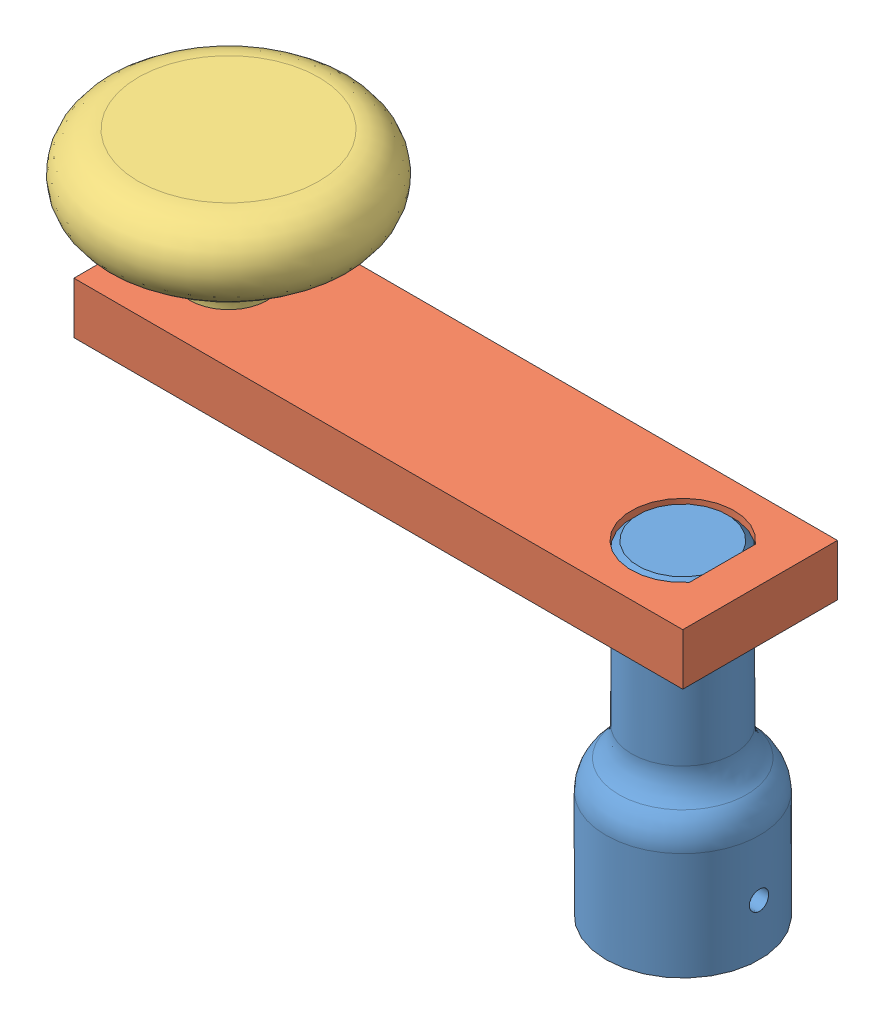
SolidWorks assembly crank sub_&.SLDASM, configuration Default (file format 15000). Lengths in mm.
Overall size (87.48 55.88 44.01).
3 component instances, 3 part files, 5 mates.
Components (placement in the parent):
- crank-shaft_&-1: crank-shaft_&.sldprt [Default] at origin size (18.92 40 18.92)
- crank-arm_&-1: crank-arm_&.sldprt [Default] at (-65.475 33.65 -9.525) size (75 6.35 19.05)
- crank-knob_&-1: crank-knob_&.sldprt [Default] at (-55.95 33.65 0) x (0.8335 0 0.55252) z (-0.55252 0 0.8335) size (31.75 22.23 31.75)
Mates (geometry in assembly coordinates):
- Concentric1: concentric anti-aligned: cylinder of crank-shaft_&-1 through (0 40 0) axis (0 -1 0) radius 6.2865; cylinder of crank-arm_&-1 through (0 33.65 0) axis (0 1 0) radius 6.35
- Parallel1: parallel anti-aligned: plane of crank-shaft_&-1 through (4.8895 33.65 3.9513) normal (1 0 0); plane of crank-arm_&-1 through (4.8895 33.65 -4.0516) normal (-1 0 0)
- Coincident2: coincident: plane of crank-shaft_&-1 through (0 33.65 0) normal (0 1 0); line of crank-arm_&-1 through (9.525 33.65 9.525) axis (0 0 -1)
- Concentric2: concentric anti-aligned: cylinder of crank-arm_&-1 through (-55.95 33.65 0) axis (0 1 0) radius 2.3813; cylinder of crank-knob_&-1 through (-55.95 33.65 0) axis (0 -1 0) radius 2.286
- Coincident3: coincident anti-aligned: plane of crank-arm_&-1 through (9.525 40 9.525) normal (0 1 0); plane of crank-knob_&-1 through (-51.9805 40 2.6314) normal (0 -1 0)
